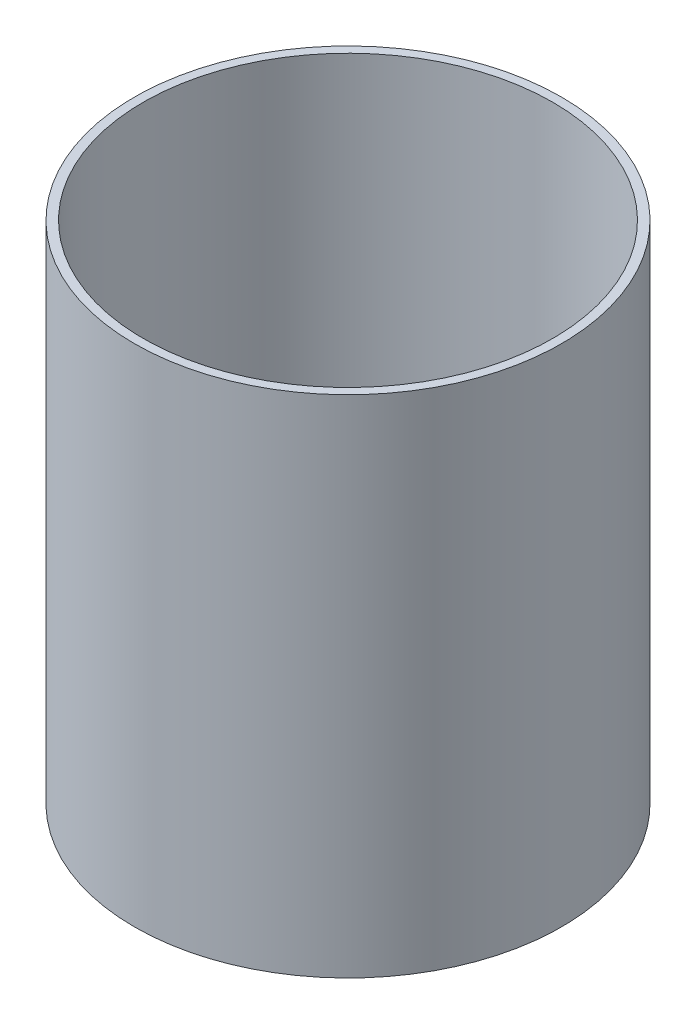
from build123d import *

# Parameters (mm, degrees)
ESQUISSE1_R      = 24.1
ESQUISSE1_R_2    = 23.1
EXTRUSION1_DEPTH = 57


with BuildPart() as part:
    # Esquisse1 → Extrusion1 (new body)
    with BuildSketch(Plane(origin=(0, 0, 0), x_dir=(1, 0, 0), z_dir=(0, 1, 0))):
        with Locations(Location((0, 0, 0), (0, 0, 90))):
            Circle(ESQUISSE1_R)
        with Locations(Location((0, 0, 0), (0, 0, 90))):
            Circle(ESQUISSE1_R_2, mode=Mode.SUBTRACT)
    extrude(amount=EXTRUSION1_DEPTH)


solid = part.part
